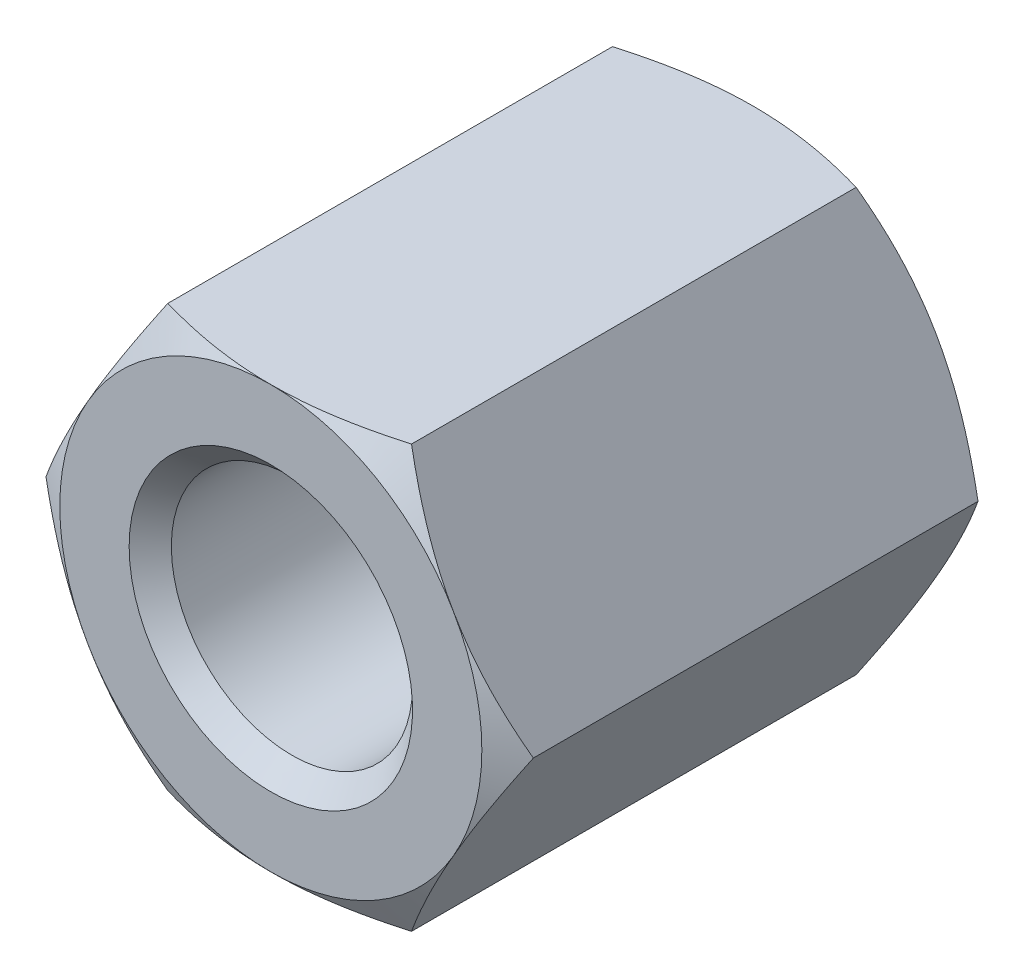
from build123d import *

# Parameters (mm, degrees)
BOSS_EXTRUDE1_DEPTH      = 4
SKETCH2_OUTSIDE_W        = 38.96
SKETCH2_OUTSIDE_H        = 37.878
SKETCH2_OUTSIDE_R        = 3.5
CUT_EXTRUDE1_DEPTH       = 7.677075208
CUT_EXTRUDE1_DRAFT       = -60
SKETCH3_R                = 2
SKETCH3_R_2              = 1.65
CUT_EXTRUDE2_DEPTH       = 4
SKETCH3_2_R              = 1.65
CUT_EXTRUDE3_DEPTH       = 5.05
CHAMFER1_SIZE            = 0.35
MIRROR1_COPY_1_SKETCH_W  = 38.96
MIRROR1_COPY_1_SKETCH_H  = 37.878
MIRROR1_COPY_1_SKETCH_R  = 3.5
MIRROR1_COPY_1_DEPTH     = 7.677075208
MIRROR1_COPY_1_DRAFT     = -60
CHAMFER1_OF_MIRROR1_SIZE = 0.35


with BuildPart() as part:
    # Sketch1 → Boss-Extrude1 (new body)
    with BuildSketch(Plane.XY):
        Polygon((2.020725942, 3.5), (-2.020725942, 3.5), (-4.041451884, 0), (-2.020725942, -3.5), (2.020725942, -3.5), (4.041451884, 0), align=None)
    boss_extrude1 = extrude(amount=-BOSS_EXTRUDE1_DEPTH)


with BuildPart() as cut_extrude1_tool:
    # Sketch2 outside → Cut-Extrude1 (with draft: the straight prism first)
    with BuildSketch(Plane(origin=(0, 0, -4), x_dir=(-1, 0, 0), z_dir=(0, 0, -1))):
        Rectangle(SKETCH2_OUTSIDE_W, SKETCH2_OUTSIDE_H)
        Circle(SKETCH2_OUTSIDE_R, mode=Mode.SUBTRACT)
    extrude(amount=-CUT_EXTRUDE1_DEPTH)
    # Cut-Extrude1: the draft: its side faces are tilted about the plane it starts from
    cut_extrude1_sides = [cut_extrude1_tool.faces().sort_by_distance(p)[0] for p in [
        (0, -18.939, -0.161462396),
        (-19.48, 0, -0.161462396),
        (0, 18.939, -0.161462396),
        (19.48, 0, -0.161462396),
        (3.5, 0, -0.161462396),
    ]]
    draft(cut_extrude1_sides, Plane(origin=(0, 0, -4), x_dir=(-1, 0, 0), z_dir=(0, 0, -1)), CUT_EXTRUDE1_DRAFT)


with BuildPart() as part_1:
    add(part.part)

    # Cut-Extrude1: cut by cut_extrude1_tool
    add(cut_extrude1_tool.part, mode=Mode.SUBTRACT)

    # Sketch3 → Cut-Extrude2 (cut)
    with BuildSketch(Plane(origin=(0, 0, -4), x_dir=(-1, 0, 0), z_dir=(0, 0, -1))):
        Circle(SKETCH3_R)
        Circle(SKETCH3_R_2, mode=Mode.SUBTRACT)
    cut_extrude2 = extrude(amount=-CUT_EXTRUDE2_DEPTH, mode=Mode.SUBTRACT)


with BuildPart() as cut_extrude2_piece_1:
    # of the separate pieces the step leaves, piece 1, a body of its own (cut_extrude2_pieces)
    add(part_1.part.solids().sort_by_distance((2.020725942, 3.5, 0))[0])

    # Chamfer1
    chamfer1_edges = [cut_extrude2_piece_1.edges().sort_by_distance(p)[0] for p in [
        (2, 0, -4),
    ]]
    chamfer(chamfer1_edges, length=CHAMFER1_SIZE)


with BuildPart() as cut_extrude2_piece_2:
    # of the separate pieces the step leaves, piece 2, a body of its own (cut_extrude2_pieces)
    add(part_1.part.solids().sort_by_distance((-1.65, 0, 0))[0])

    # Sketch3_2 → Cut-Extrude3 (cut)
    with BuildSketch(Plane(origin=(0, 0, -4), x_dir=(-1, 0, 0), z_dir=(0, 0, -1))):
        Circle(SKETCH3_2_R)
    cut_extrude3 = extrude(amount=-CUT_EXTRUDE3_DEPTH, mode=Mode.SUBTRACT)


with BuildPart() as cut_extrude2_piece_1_1:
    add(cut_extrude2_piece_1.part)

    # Mirror1: Boss-Extrude1, Cut-Extrude2, Cut-Extrude3 across plane
    add(boss_extrude1.mirror(Plane.XY))
    add(cut_extrude2.mirror(Plane.XY), mode=Mode.SUBTRACT)
    add(cut_extrude3.mirror(Plane.XY), mode=Mode.SUBTRACT)


with BuildPart() as mirror1_copy_1_tool:
    # Mirror1 copy 1 sketch → Mirror1 copy 1 (with draft: the straight prism first)
    with BuildSketch(Plane(origin=(0, 0, 4), x_dir=(-1, 0, 0), z_dir=(0, 0, 1))):
        Rectangle(MIRROR1_COPY_1_SKETCH_W, MIRROR1_COPY_1_SKETCH_H)
        Circle(MIRROR1_COPY_1_SKETCH_R, mode=Mode.SUBTRACT)
    extrude(amount=-MIRROR1_COPY_1_DEPTH)
    # Mirror1 copy 1: the draft: its side faces are tilted about the plane it starts from
    mirror1_copy_1_sides = [mirror1_copy_1_tool.faces().sort_by_distance(p)[0] for p in [
        (0, -18.939, 0.161462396),
        (-19.48, 0, 0.161462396),
        (0, 18.939, 0.161462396),
        (19.48, 0, 0.161462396),
        (3.5, 0, 0.161462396),
    ]]
    draft(mirror1_copy_1_sides, Plane(origin=(0, 0, 4), x_dir=(-1, 0, 0), z_dir=(0, 0, 1)), MIRROR1_COPY_1_DRAFT)


with BuildPart() as cut_extrude2_piece_1_2:
    add(cut_extrude2_piece_1_1.part)

    # Mirror1 copy 1: cut by mirror1_copy_1_tool
    add(mirror1_copy_1_tool.part, mode=Mode.SUBTRACT)

    # Chamfer1 of Mirror1
    chamfer1_of_mirror1_edges = [cut_extrude2_piece_1_2.edges().sort_by_distance(p)[0] for p in [
        (2, 0, 4),
    ]]
    chamfer(chamfer1_of_mirror1_edges, length=CHAMFER1_OF_MIRROR1_SIZE)


solid = cut_extrude2_piece_1_2.part
